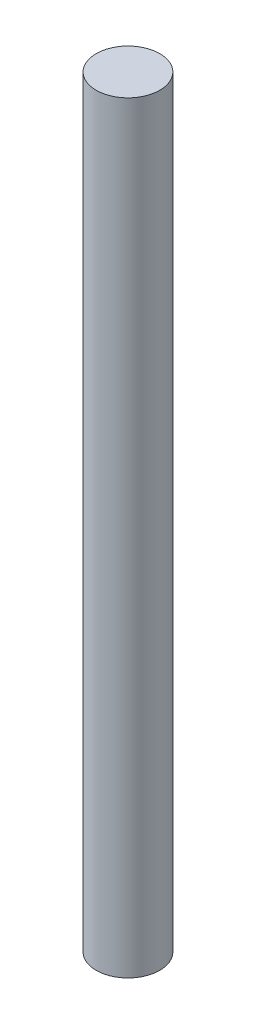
ISO-10303-21;
HEADER;
FILE_DESCRIPTION(('STEP AP214'),'2;1');
FILE_NAME('part.step','',(''),(''),'','','');
FILE_SCHEMA(('AUTOMOTIVE_DESIGN { 1 0 10303 214 1 1 1 1 }'));
ENDSEC;
DATA;
#1=APPLICATION_CONTEXT('core data for automotive mechanical design processes');
#2=APPLICATION_PROTOCOL_DEFINITION('international standard','automotive_design',2000,#1);
#3=PRODUCT_CONTEXT('',#1,'mechanical');
#4=PRODUCT('Part','Part','',(#3));
#5=PRODUCT_RELATED_PRODUCT_CATEGORY('part','',(#4));
#6=PRODUCT_DEFINITION_FORMATION('','',#4);
#7=PRODUCT_DEFINITION_CONTEXT('part definition',#1,'design');
#8=PRODUCT_DEFINITION('design','',#6,#7);
#9=PRODUCT_DEFINITION_SHAPE('','',#8);
#10=(LENGTH_UNIT() NAMED_UNIT(*) SI_UNIT(.MILLI.,.METRE.));
#11=(NAMED_UNIT(*) PLANE_ANGLE_UNIT() SI_UNIT($,.RADIAN.));
#12=(NAMED_UNIT(*) SI_UNIT($,.STERADIAN.) SOLID_ANGLE_UNIT());
#13=UNCERTAINTY_MEASURE_WITH_UNIT(LENGTH_MEASURE(1.E-05),#10,'distance_accuracy_value','');
#14=(GEOMETRIC_REPRESENTATION_CONTEXT(3) GLOBAL_UNCERTAINTY_ASSIGNED_CONTEXT((#13)) GLOBAL_UNIT_ASSIGNED_CONTEXT((#10,
#11,#12)) REPRESENTATION_CONTEXT('',''));
#15=CARTESIAN_POINT('',(0.,0.,0.));
#16=DIRECTION('',(0.,0.,1.));
#17=DIRECTION('',(1.,0.,0.));
#18=AXIS2_PLACEMENT_3D('',#15,#16,#17);
#19=CARTESIAN_POINT('',(0.,228.6,0.));
#20=DIRECTION('',(0.,-1.,0.));
#21=DIRECTION('',(0.,0.,-1.));
#22=AXIS2_PLACEMENT_3D('',#19,#20,#21);
#23=CYLINDRICAL_SURFACE('',#22,9.525);
#24=CARTESIAN_POINT('',(0.,228.6,0.));
#25=DIRECTION('',(0.,1.,0.));
#26=DIRECTION('',(0.,0.,1.));
#27=AXIS2_PLACEMENT_3D('',#24,#25,#26);
#28=CIRCLE('',#27,9.525);
#29=CARTESIAN_POINT('',(0.,228.6,9.525));
#30=VERTEX_POINT('',#29);
#31=EDGE_CURVE('E10',#30,#30,#28,.T.);
#32=ORIENTED_EDGE('',*,*,#31,.F.);
#33=EDGE_LOOP('',(#32));
#34=FACE_BOUND('',#33,.T.);
#35=CARTESIAN_POINT('',(0.,0.,0.));
#36=DIRECTION('',(0.,1.,0.));
#37=DIRECTION('',(0.,0.,1.));
#38=AXIS2_PLACEMENT_3D('',#35,#36,#37);
#39=CIRCLE('',#38,9.525);
#40=CARTESIAN_POINT('',(0.,0.,9.525));
#41=VERTEX_POINT('',#40);
#42=EDGE_CURVE('E34',#41,#41,#39,.T.);
#43=ORIENTED_EDGE('',*,*,#42,.T.);
#44=EDGE_LOOP('',(#43));
#45=FACE_BOUND('',#44,.T.);
#46=ADVANCED_FACE('F28',(#34,#45),#23,.T.);
#47=CARTESIAN_POINT('',(0.,228.6,0.));
#48=DIRECTION('',(0.,1.,0.));
#49=DIRECTION('',(0.,0.,1.));
#50=AXIS2_PLACEMENT_3D('',#47,#48,#49);
#51=PLANE('',#50);
#52=ORIENTED_EDGE('',*,*,#31,.T.);
#53=EDGE_LOOP('',(#52));
#54=FACE_BOUND('',#53,.T.);
#55=ADVANCED_FACE('F43',(#54),#51,.T.);
#56=CARTESIAN_POINT('',(0.,0.,0.));
#57=DIRECTION('',(0.,1.,0.));
#58=DIRECTION('',(0.,0.,1.));
#59=AXIS2_PLACEMENT_3D('',#56,#57,#58);
#60=PLANE('',#59);
#61=ORIENTED_EDGE('',*,*,#42,.F.);
#62=EDGE_LOOP('',(#61));
#63=FACE_BOUND('',#62,.T.);
#64=ADVANCED_FACE('F41',(#63),#60,.F.);
#65=CLOSED_SHELL('',(#46,#55,#64));
#66=MANIFOLD_SOLID_BREP('B2',#65);
#67=ADVANCED_BREP_SHAPE_REPRESENTATION('',(#18,#66),#14);
#68=SHAPE_DEFINITION_REPRESENTATION(#9,#67);
ENDSEC;
END-ISO-10303-21;
